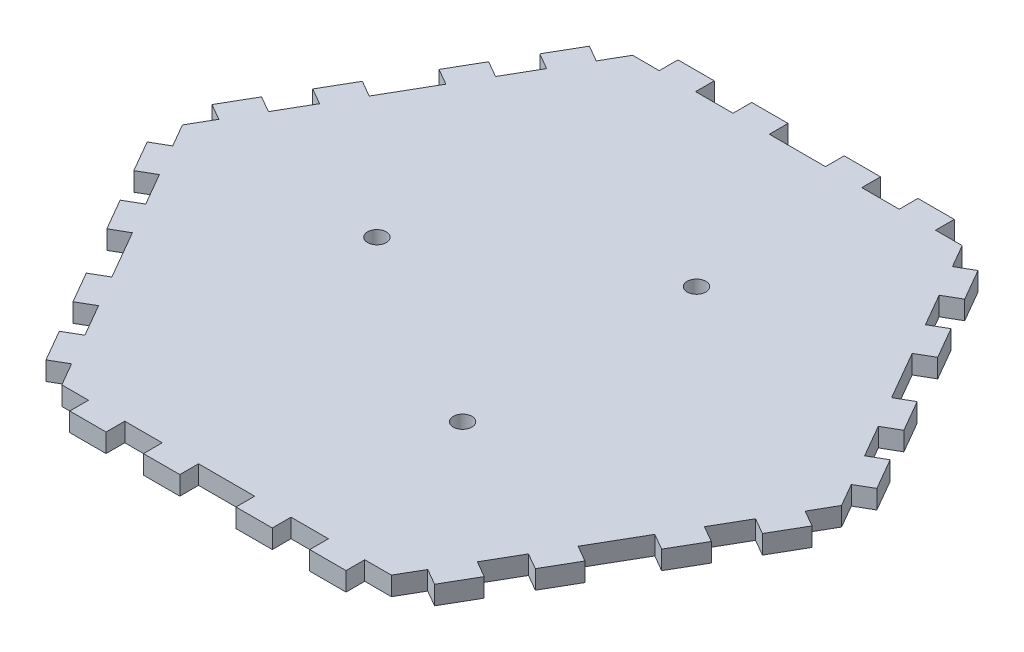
from build123d import *

# Parameters (mm, degrees)
SKETCH1_R           = 1
BOSS_EXTRUDE1_DEPTH = 2
SKETCH2_W           = 6
SKETCH2_H           = 2
SKETCH2_W_2         = 4
CUT_EXTRUDE2_DEPTH  = 2
SKETCH1_3_R         = 1
CUT_EXTRUDE4_DEPTH  = 10


with BuildPart() as part:
    # Sketch1 → Boss-Extrude1 (new body)
    # profile 1 of 4: a face of its own
    with BuildSketch(Plane(origin=(0, 0, 0), x_dir=(1, 0, 0), z_dir=(0, 1, 0))):
        Polygon((-18.763883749, -32.5), (18.763883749, -32.5), (37.527767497, 0), (18.763883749, 32.5), (-18.763883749, 32.5), (-37.527767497, 0), align=None)
        with Locations((-14.43375673, 0)):
            Circle(SKETCH1_R, mode=Mode.SUBTRACT)
        with Locations((7.216878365, -12.5)):
            Circle(SKETCH1_R, mode=Mode.SUBTRACT)
        with Locations((7.216878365, 12.5)):
            Circle(SKETCH1_R, mode=Mode.SUBTRACT)
    # profile 2 of 4: a face of its own
    with BuildSketch(Plane(origin=(0, 0, 0), x_dir=(1, 0, 0), z_dir=(0, 1, 0))):
        with Locations((7.216878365, 12.5)):
            Circle(SKETCH1_R)
    # profile 3 of 4: a face of its own
    with BuildSketch(Plane(origin=(0, 0, 0), x_dir=(1, 0, 0), z_dir=(0, 1, 0))):
        with Locations((-14.43375673, 0)):
            Circle(SKETCH1_R)
    # profile 4 of 4: a face of its own
    with BuildSketch(Plane(origin=(0, 0, 0), x_dir=(1, 0, 0), z_dir=(0, 1, 0))):
        with Locations((7.216878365, -12.5)):
            Circle(SKETCH1_R)
    extrude(amount=BOSS_EXTRUDE1_DEPTH)

    # Sketch2 → Cut-Extrude2 (cut)
    with BuildSketch(Plane(origin=(0, 2, 0), x_dir=(1, 0, 0), z_dir=(0, 1, 0))):
        Polygon((-17.60918321, -30.5), (-14.763883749, -30.5), (-14.763883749, -32.5), (-18.763883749, -32.5), (-20.763883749, -29.035898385), (-19.031832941, -28.035898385), align=None)
        with Locations((0, -31.5)):
            Rectangle(SKETCH2_W, SKETCH2_H)
        with Locations((-8.881941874, -31.5)):
            Rectangle(SKETCH2_W_2, SKETCH2_H)
        with Locations((8.881941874, -31.5)):
            Rectangle(SKETCH2_W_2, SKETCH2_H)
        Polygon((14.763883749, -32.5), (18.763883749, -32.5), (20.763883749, -29.035898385), (19.031832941, -28.035898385), (17.60918321, -30.5), (14.763883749, -30.5), align=None)
        Polygon((-33.79571669, -2.464101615), (-35.527767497, -3.464101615), (-37.527767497, 0), (-35.527767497, 3.464101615), (-33.79571669, 2.464101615), (-35.218366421, 0), align=None)
        Polygon((-26.645825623, -18.848076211), (-29.645825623, -13.651923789), (-27.913774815, -12.651923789), (-24.913774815, -17.848076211), align=None)
        Polygon((-33.58679656, -6.825961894), (-31.58679656, -10.290063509), (-29.854745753, -9.290063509), (-31.854745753, -5.825961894), align=None)
        Polygon((-24.704854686, -22.209936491), (-22.972803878, -21.209936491), (-20.972803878, -24.674038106), (-22.704854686, -25.674038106), align=None)
        Polygon((-19.031832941, 28.035898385), (-20.763883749, 29.035898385), (-18.763883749, 32.5), (-14.763883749, 32.5), (-14.763883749, 30.5), (-17.60918321, 30.5), align=None)
        Polygon((-29.645825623, 13.651923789), (-26.645825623, 18.848076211), (-24.913774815, 17.848076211), (-27.913774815, 12.651923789), align=None)
        Polygon((-22.704854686, 25.674038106), (-24.704854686, 22.209936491), (-22.972803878, 21.209936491), (-20.972803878, 24.674038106), align=None)
        Polygon((-31.58679656, 10.290063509), (-29.854745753, 9.290063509), (-31.854745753, 5.825961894), (-33.58679656, 6.825961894), align=None)
        Polygon((14.763883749, 30.5), (14.763883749, 32.5), (18.763883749, 32.5), (20.763883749, 29.035898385), (19.031832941, 28.035898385), (17.60918321, 30.5), align=None)
        with Locations((0, 31.5)):
            Rectangle(SKETCH2_W, SKETCH2_H)
        with Locations((8.881941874, 31.5)):
            Rectangle(SKETCH2_W_2, SKETCH2_H)
        with Locations((-8.881941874, 31.5)):
            Rectangle(SKETCH2_W_2, SKETCH2_H)
        Polygon((33.79571669, 2.464101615), (35.527767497, 3.464101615), (37.527767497, 0), (35.527767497, -3.464101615), (33.79571669, -2.464101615), (35.218366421, 0), align=None)
        Polygon((26.645825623, 18.848076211), (29.645825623, 13.651923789), (27.913774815, 12.651923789), (24.913774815, 17.848076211), align=None)
        Polygon((33.58679656, 6.825961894), (31.58679656, 10.290063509), (29.854745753, 9.290063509), (31.854745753, 5.825961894), align=None)
        Polygon((24.704854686, 22.209936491), (22.972803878, 21.209936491), (20.972803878, 24.674038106), (22.704854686, 25.674038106), align=None)
        Polygon((29.645825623, -13.651923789), (26.645825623, -18.848076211), (24.913774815, -17.848076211), (27.913774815, -12.651923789), align=None)
        Polygon((22.704854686, -25.674038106), (24.704854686, -22.209936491), (22.972803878, -21.209936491), (20.972803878, -24.674038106), align=None)
        Polygon((31.58679656, -10.290063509), (29.854745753, -9.290063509), (31.854745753, -5.825961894), (33.58679656, -6.825961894), align=None)
    extrude(amount=-CUT_EXTRUDE2_DEPTH, mode=Mode.SUBTRACT)

    # Sketch1_3 → Cut-Extrude4 (cut)
    with BuildSketch(Plane(origin=(0, 0, 0), x_dir=(1, 0, 0), z_dir=(0, 1, 0))):
        with Locations(Location((7.216878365, -12.5, 0), (0, 0, 270))):
            Circle(SKETCH1_3_R)
        with Locations(Location((7.216878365, 12.5, 0), (0, 0, 270))):
            Circle(SKETCH1_3_R)
        with Locations(Location((-14.43375673, 0, 0), (0, 0, 270))):
            Circle(SKETCH1_3_R)
    extrude(amount=CUT_EXTRUDE4_DEPTH, mode=Mode.SUBTRACT)


solid = part.part
